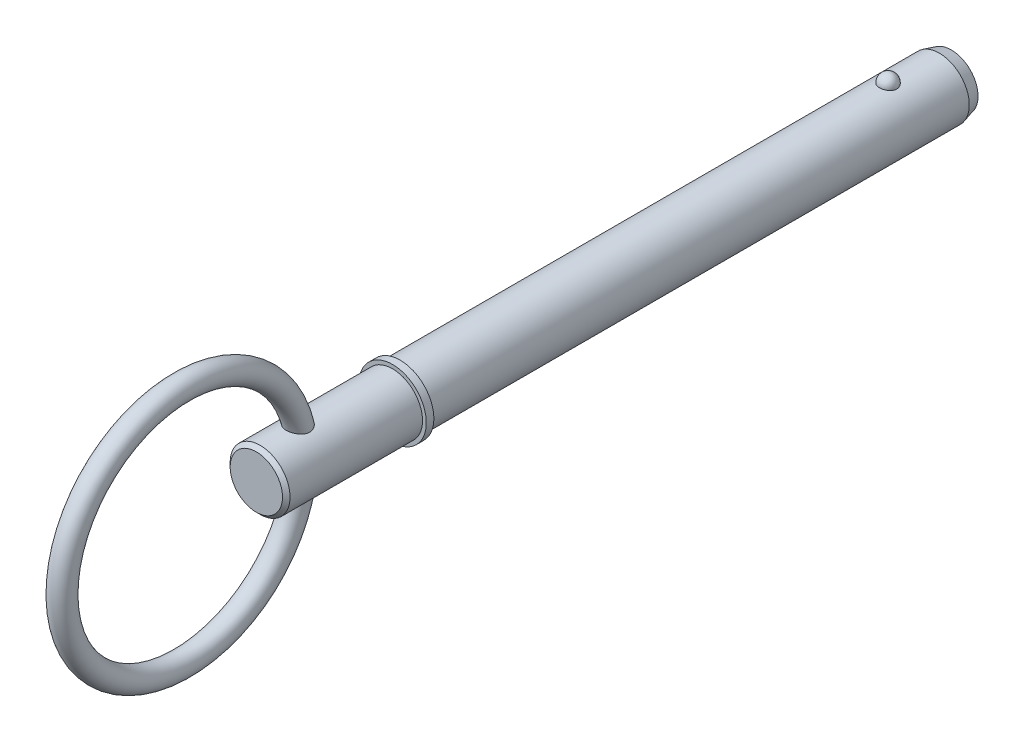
ISO-10303-21;
HEADER;
FILE_DESCRIPTION(('STEP AP214'),'2;1');
FILE_NAME('part.step','',(''),(''),'','','');
FILE_SCHEMA(('AUTOMOTIVE_DESIGN { 1 0 10303 214 1 1 1 1 }'));
ENDSEC;
DATA;
#1=APPLICATION_CONTEXT('core data for automotive mechanical design processes');
#2=APPLICATION_PROTOCOL_DEFINITION('international standard','automotive_design',2000,#1);
#3=PRODUCT_CONTEXT('',#1,'mechanical');
#4=PRODUCT('Part','Part','',(#3));
#5=PRODUCT_RELATED_PRODUCT_CATEGORY('part','',(#4));
#6=PRODUCT_DEFINITION_FORMATION('','',#4);
#7=PRODUCT_DEFINITION_CONTEXT('part definition',#1,'design');
#8=PRODUCT_DEFINITION('design','',#6,#7);
#9=PRODUCT_DEFINITION_SHAPE('','',#8);
#10=(LENGTH_UNIT() NAMED_UNIT(*) SI_UNIT(.MILLI.,.METRE.));
#11=(NAMED_UNIT(*) PLANE_ANGLE_UNIT() SI_UNIT($,.RADIAN.));
#12=(NAMED_UNIT(*) SI_UNIT($,.STERADIAN.) SOLID_ANGLE_UNIT());
#13=UNCERTAINTY_MEASURE_WITH_UNIT(LENGTH_MEASURE(1.E-05),#10,'distance_accuracy_value','');
#14=(GEOMETRIC_REPRESENTATION_CONTEXT(3) GLOBAL_UNCERTAINTY_ASSIGNED_CONTEXT((#13)) GLOBAL_UNIT_ASSIGNED_CONTEXT((#10,
#11,#12)) REPRESENTATION_CONTEXT('',''));
#15=CARTESIAN_POINT('',(0.,0.,0.));
#16=DIRECTION('',(0.,0.,1.));
#17=DIRECTION('',(1.,0.,0.));
#18=AXIS2_PLACEMENT_3D('',#15,#16,#17);
#19=CARTESIAN_POINT('',(0.,0.,63.5));
#20=DIRECTION('',(0.,0.,-1.));
#21=DIRECTION('',(-1.,0.,0.));
#22=AXIS2_PLACEMENT_3D('',#19,#20,#21);
#23=CYLINDRICAL_SURFACE('',#22,3.97);
#24=CARTESIAN_POINT('',(1.13787398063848,3.80343828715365,-1.15));
#25=CARTESIAN_POINT('',(1.13787307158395,3.80343910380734,-1.0857397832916));
#26=CARTESIAN_POINT('',(1.13264657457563,3.80501406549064,-1.02146820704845));
#27=CARTESIAN_POINT('',(1.11186534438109,3.81113760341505,-0.894749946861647));
#28=CARTESIAN_POINT('',(1.09630734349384,3.81568712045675,-0.832303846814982));
#29=CARTESIAN_POINT('',(1.05525533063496,3.82724281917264,-0.711040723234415));
#30=CARTESIAN_POINT('',(1.02976565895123,3.83424792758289,-0.652222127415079));
#31=CARTESIAN_POINT('',(0.969477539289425,3.84993235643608,-0.53981446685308));
#32=CARTESIAN_POINT('',(0.934679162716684,3.85861166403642,-0.486225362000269));
#33=CARTESIAN_POINT('',(0.856427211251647,3.87673176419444,-0.385470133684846));
#34=CARTESIAN_POINT('',(0.812928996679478,3.88617632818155,-0.338339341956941));
#35=CARTESIAN_POINT('',(0.718506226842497,3.90473543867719,-0.252134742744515));
#36=CARTESIAN_POINT('',(0.667581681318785,3.91384998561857,-0.213060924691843));
#37=CARTESIAN_POINT('',(0.559829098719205,3.93070626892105,-0.144169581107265));
#38=CARTESIAN_POINT('',(0.503019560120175,3.93845211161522,-0.114324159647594));
#39=CARTESIAN_POINT('',(0.384957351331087,3.95173781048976,-0.0645874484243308));
#40=CARTESIAN_POINT('',(0.323705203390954,3.95727792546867,-0.0446949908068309));
#41=CARTESIAN_POINT('',(0.1997490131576,3.96544869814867,-0.0157294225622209));
#42=CARTESIAN_POINT('',(0.137095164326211,3.96813298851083,-0.00645660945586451));
#43=CARTESIAN_POINT('',(0.0110617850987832,3.97048461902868,0.00167939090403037));
#44=CARTESIAN_POINT('',(-0.0523176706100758,3.97015226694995,0.000543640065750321));
#45=CARTESIAN_POINT('',(-0.176983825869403,3.96653606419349,-0.0120046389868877));
#46=CARTESIAN_POINT('',(-0.238287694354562,3.96329719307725,-0.0232605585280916));
#47=CARTESIAN_POINT('',(-0.358077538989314,3.95427494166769,-0.0555133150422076));
#48=CARTESIAN_POINT('',(-0.41656346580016,3.94849151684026,-0.0765103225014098));
#49=CARTESIAN_POINT('',(-0.529474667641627,3.9349475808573,-0.127824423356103));
#50=CARTESIAN_POINT('',(-0.583873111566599,3.92717527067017,-0.158197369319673));
#51=CARTESIAN_POINT('',(-0.686796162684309,3.9104901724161,-0.227402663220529));
#52=CARTESIAN_POINT('',(-0.735320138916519,3.90157726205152,-0.266235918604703));
#53=CARTESIAN_POINT('',(-0.826197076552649,3.88336108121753,-0.352210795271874));
#54=CARTESIAN_POINT('',(-0.868404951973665,3.87405356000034,-0.399504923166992));
#55=CARTESIAN_POINT('',(-0.944393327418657,3.85623507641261,-0.500572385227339));
#56=CARTESIAN_POINT('',(-0.978173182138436,3.84772417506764,-0.554346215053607));
#57=CARTESIAN_POINT('',(-1.036841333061,3.83233550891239,-0.667624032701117));
#58=CARTESIAN_POINT('',(-1.06161430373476,3.82547928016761,-0.727190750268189));
#59=CARTESIAN_POINT('',(-1.1010562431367,3.81431496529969,-0.849806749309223));
#60=CARTESIAN_POINT('',(-1.11572551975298,3.81000680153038,-0.912855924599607));
#61=CARTESIAN_POINT('',(-1.13455293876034,3.80444307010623,-1.04035299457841));
#62=CARTESIAN_POINT('',(-1.13875701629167,3.80317416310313,-1.10479351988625));
#63=CARTESIAN_POINT('',(-1.13668244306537,3.80379469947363,-1.23348881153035));
#64=CARTESIAN_POINT('',(-1.13040410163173,3.80568404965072,-1.29774358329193));
#65=CARTESIAN_POINT('',(-1.10758455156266,3.81238701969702,-1.42388263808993));
#66=CARTESIAN_POINT('',(-1.09109911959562,3.81718474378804,-1.48577787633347));
#67=CARTESIAN_POINT('',(-1.04831897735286,3.82915360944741,-1.6058363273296));
#68=CARTESIAN_POINT('',(-1.02202385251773,3.83632485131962,-1.66399938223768));
#69=CARTESIAN_POINT('',(-0.960087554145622,3.85229234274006,-1.77531672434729));
#70=CARTESIAN_POINT('',(-0.924393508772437,3.86109769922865,-1.82844028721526));
#71=CARTESIAN_POINT('',(-0.844617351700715,3.87932868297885,-1.92784641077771));
#72=CARTESIAN_POINT('',(-0.800534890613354,3.88875433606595,-1.97412868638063));
#73=CARTESIAN_POINT('',(-0.704909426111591,3.90722138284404,-2.05875748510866));
#74=CARTESIAN_POINT('',(-0.653336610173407,3.91626104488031,-2.09707073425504));
#75=CARTESIAN_POINT('',(-0.544251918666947,3.93290335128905,-2.16444159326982));
#76=CARTESIAN_POINT('',(-0.486740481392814,3.94050610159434,-2.19349988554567));
#77=CARTESIAN_POINT('',(-0.368186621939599,3.95333328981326,-2.24120607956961));
#78=CARTESIAN_POINT('',(-0.307200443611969,3.9585876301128,-2.25998559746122));
#79=CARTESIAN_POINT('',(-0.182787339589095,3.96627905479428,-2.28716436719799));
#80=CARTESIAN_POINT('',(-0.119360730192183,3.96871650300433,-2.29556495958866));
#81=CARTESIAN_POINT('',(0.00676344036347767,3.97048518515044,-2.30167748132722));
#82=CARTESIAN_POINT('',(0.0694499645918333,3.96987797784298,-2.299601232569));
#83=CARTESIAN_POINT('',(0.193555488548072,3.96576491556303,-2.28530777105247));
#84=CARTESIAN_POINT('',(0.254974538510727,3.96225917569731,-2.27309096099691));
#85=CARTESIAN_POINT('',(0.374550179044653,3.95274547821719,-2.2389384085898));
#86=CARTESIAN_POINT('',(0.432719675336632,3.94674835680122,-2.2170447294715));
#87=CARTESIAN_POINT('',(0.544514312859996,3.93288448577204,-2.16414952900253));
#88=CARTESIAN_POINT('',(0.598139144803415,3.92501760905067,-2.13314738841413));
#89=CARTESIAN_POINT('',(0.700284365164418,3.90809781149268,-2.06228741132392));
#90=CARTESIAN_POINT('',(0.748708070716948,3.89902775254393,-2.02229434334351));
#91=CARTESIAN_POINT('',(0.838215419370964,3.88077133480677,-1.93481443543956));
#92=CARTESIAN_POINT('',(0.879297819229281,3.87158495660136,-1.88732632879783));
#93=CARTESIAN_POINT('',(0.953804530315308,3.85391414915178,-1.78516284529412));
#94=CARTESIAN_POINT('',(0.987071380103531,3.8454460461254,-1.73036973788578));
#95=CARTESIAN_POINT('',(1.04410491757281,3.83035507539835,-1.61582422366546));
#96=CARTESIAN_POINT('',(1.06787445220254,3.82373165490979,-1.5560733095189));
#97=CARTESIAN_POINT('',(1.10358064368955,3.813570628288,-1.43904746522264));
#98=CARTESIAN_POINT('',(1.11641754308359,3.80980198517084,-1.38206535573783));
#99=CARTESIAN_POINT('',(1.13356451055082,3.80473547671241,-1.26672526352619));
#100=CARTESIAN_POINT('',(1.13787480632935,3.80343754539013,-1.20836731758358));
#101=CARTESIAN_POINT('',(1.13787398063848,3.80343828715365,-1.15));
#102=B_SPLINE_CURVE_WITH_KNOTS('',3,(#24,#25,#26,#27,#28,#29,#30,#31,#32,#33,#34,#35,#36,#37,
#38,#39,#40,#41,#42,#43,#44,#45,#46,#47,#48,#49,#50,#51,#52,#53,#54,#55,#56,#57,#58,#59,#60,#61,
#62,#63,#64,#65,#66,#67,#68,#69,#70,#71,#72,#73,#74,#75,#76,#77,#78,#79,#80,#81,#82,#83,#84,#85,
#86,#87,#88,#89,#90,#91,#92,#93,#94,#95,#96,#97,#98,#99,#100,#101),.UNSPECIFIED.,.T.,.F.,(4,2,2,
2,2,2,2,2,2,2,2,2,2,2,2,2,2,2,2,2,2,2,2,2,2,2,2,2,2,2,2,2,2,2,2,2,2,2,4),(0.,0.192571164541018,
0.385203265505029,0.577751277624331,0.770297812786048,0.963858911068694,1.15741975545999,
1.35038964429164,1.54333688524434,1.73259288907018,1.92182958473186,2.10818732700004,
2.2945483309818,2.48204164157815,2.66955507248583,2.86087083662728,3.05220124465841,
3.24590171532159,3.43959628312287,3.63243915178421,3.82527632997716,4.01706893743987,
4.20886965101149,4.40177324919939,4.59468488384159,4.78838651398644,4.9820738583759,
5.17321934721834,5.36434014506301,5.55161251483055,5.7388774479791,5.92533626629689,
6.11180776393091,6.30129785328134,6.49082000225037,6.68388392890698,6.87688993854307,
7.05180628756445,7.22671796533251),.UNSPECIFIED.);
#103=CARTESIAN_POINT('',(1.13787398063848,3.80343828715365,-1.15));
#104=VERTEX_POINT('',#103);
#105=EDGE_CURVE('E102',#104,#104,#102,.T.);
#106=ORIENTED_EDGE('',*,*,#105,.T.);
#107=EDGE_LOOP('',(#106));
#108=FACE_BOUND('',#107,.T.);
#109=CARTESIAN_POINT('',(0.,0.,-7.94399999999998));
#110=DIRECTION('',(0.,0.,-1.));
#111=DIRECTION('',(-1.,0.,0.));
#112=AXIS2_PLACEMENT_3D('',#109,#110,#111);
#113=CIRCLE('',#112,3.97);
#114=CARTESIAN_POINT('',(-3.97,0.,-7.94399999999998));
#115=VERTEX_POINT('',#114);
#116=EDGE_CURVE('E110',#115,#115,#113,.F.);
#117=ORIENTED_EDGE('',*,*,#116,.T.);
#118=EDGE_LOOP('',(#117));
#119=FACE_BOUND('',#118,.T.);
#120=CARTESIAN_POINT('',(0.,0.,63.5));
#121=DIRECTION('',(0.,0.,1.));
#122=DIRECTION('',(1.,0.,0.));
#123=AXIS2_PLACEMENT_3D('',#120,#121,#122);
#124=CIRCLE('',#123,3.97);
#125=CARTESIAN_POINT('',(3.97,0.,63.5));
#126=VERTEX_POINT('',#125);
#127=EDGE_CURVE('E108',#126,#126,#124,.T.);
#128=ORIENTED_EDGE('',*,*,#127,.F.);
#129=EDGE_LOOP('',(#128));
#130=FACE_BOUND('',#129,.T.);
#131=ADVANCED_FACE('F39',(#108,#119,#130),#23,.T.);
#132=CARTESIAN_POINT('',(0.,0.,-9.53));
#133=DIRECTION('',(0.,0.,-1.));
#134=DIRECTION('',(-1.,0.,0.));
#135=AXIS2_PLACEMENT_3D('',#132,#133,#134);
#136=PLANE('',#135);
#137=CARTESIAN_POINT('',(0.,0.,-9.53));
#138=DIRECTION('',(0.,0.,-1.));
#139=DIRECTION('',(-1.,0.,0.));
#140=AXIS2_PLACEMENT_3D('',#137,#138,#139);
#141=CIRCLE('',#140,3.54503258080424);
#142=CARTESIAN_POINT('',(-3.54503258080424,0.,-9.53));
#143=VERTEX_POINT('',#142);
#144=EDGE_CURVE('E142',#143,#143,#141,.T.);
#145=ORIENTED_EDGE('',*,*,#144,.T.);
#146=EDGE_LOOP('',(#145));
#147=FACE_BOUND('',#146,.T.);
#148=ADVANCED_FACE('F88',(#147),#136,.T.);
#149=CARTESIAN_POINT('',(0.,0.,-9.53));
#150=DIRECTION('',(0.,0.,1.));
#151=DIRECTION('',(1.,0.,0.));
#152=AXIS2_PLACEMENT_3D('',#149,#150,#151);
#153=CONICAL_SURFACE('',#152,3.54503258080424,0.261799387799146);
#154=ORIENTED_EDGE('',*,*,#116,.F.);
#155=EDGE_LOOP('',(#154));
#156=FACE_BOUND('',#155,.T.);
#157=ORIENTED_EDGE('',*,*,#144,.F.);
#158=EDGE_LOOP('',(#157));
#159=FACE_BOUND('',#158,.T.);
#160=ADVANCED_FACE('F94',(#156,#159),#153,.T.);
#161=CARTESIAN_POINT('',(0.,3.97,-1.15));
#162=DIRECTION('',(0.,1.,0.));
#163=DIRECTION('',(0.,0.,-1.));
#164=AXIS2_PLACEMENT_3D('',#161,#162,#163);
#165=SPHERICAL_SURFACE('',#164,1.15);
#166=ORIENTED_EDGE('',*,*,#105,.F.);
#167=EDGE_LOOP('',(#166));
#168=FACE_BOUND('',#167,.T.);
#169=ADVANCED_FACE('F113',(#168),#165,.T.);
#170=CARTESIAN_POINT('',(0.,0.,63.5));
#171=DIRECTION('',(0.,0.,-1.));
#172=DIRECTION('',(-1.,0.,0.));
#173=AXIS2_PLACEMENT_3D('',#170,#171,#172);
#174=PLANE('',#173);
#175=ORIENTED_EDGE('',*,*,#127,.T.);
#176=EDGE_LOOP('',(#175));
#177=FACE_BOUND('',#176,.T.);
#178=CARTESIAN_POINT('',(0.,0.,63.5));
#179=DIRECTION('',(0.,0.,-1.));
#180=DIRECTION('',(-1.,0.,0.));
#181=AXIS2_PLACEMENT_3D('',#178,#179,#180);
#182=CIRCLE('',#181,4.47);
#183=CARTESIAN_POINT('',(-4.47,0.,63.5));
#184=VERTEX_POINT('',#183);
#185=EDGE_CURVE('E109',#184,#184,#182,.T.);
#186=ORIENTED_EDGE('',*,*,#185,.T.);
#187=EDGE_LOOP('',(#186));
#188=FACE_BOUND('',#187,.T.);
#189=ADVANCED_FACE('F117',(#177,#188),#174,.T.);
#190=CARTESIAN_POINT('',(0.,0.,33.7287874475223));
#191=DIRECTION('',(0.,0.,-1.));
#192=DIRECTION('',(-1.,0.,0.));
#193=AXIS2_PLACEMENT_3D('',#190,#191,#192);
#194=CYLINDRICAL_SURFACE('',#193,4.47);
#195=CARTESIAN_POINT('',(0.,0.,64.5));
#196=DIRECTION('',(0.,0.,-1.));
#197=DIRECTION('',(-1.,0.,0.));
#198=AXIS2_PLACEMENT_3D('',#195,#196,#197);
#199=CIRCLE('',#198,4.47);
#200=CARTESIAN_POINT('',(-4.47,0.,64.5));
#201=VERTEX_POINT('',#200);
#202=EDGE_CURVE('E134',#201,#201,#199,.T.);
#203=ORIENTED_EDGE('',*,*,#202,.T.);
#204=EDGE_LOOP('',(#203));
#205=FACE_BOUND('',#204,.T.);
#206=ORIENTED_EDGE('',*,*,#185,.F.);
#207=EDGE_LOOP('',(#206));
#208=FACE_BOUND('',#207,.T.);
#209=ADVANCED_FACE('F121',(#205,#208),#194,.T.);
#210=CARTESIAN_POINT('',(0.,4.47,64.5));
#211=DIRECTION('',(0.,0.,1.));
#212=DIRECTION('',(1.,0.,0.));
#213=AXIS2_PLACEMENT_3D('',#210,#211,#212);
#214=PLANE('',#213);
#215=CARTESIAN_POINT('',(0.,0.,64.5));
#216=DIRECTION('',(0.,0.,1.));
#217=DIRECTION('',(1.,0.,0.));
#218=AXIS2_PLACEMENT_3D('',#215,#216,#217);
#219=CIRCLE('',#218,3.97);
#220=CARTESIAN_POINT('',(3.97,0.,64.5));
#221=VERTEX_POINT('',#220);
#222=EDGE_CURVE('E112',#221,#221,#219,.T.);
#223=ORIENTED_EDGE('',*,*,#222,.F.);
#224=EDGE_LOOP('',(#223));
#225=FACE_BOUND('',#224,.T.);
#226=ORIENTED_EDGE('',*,*,#202,.F.);
#227=EDGE_LOOP('',(#226));
#228=FACE_BOUND('',#227,.T.);
#229=ADVANCED_FACE('F85',(#225,#228),#214,.T.);
#230=CARTESIAN_POINT('',(0.,0.,82.55));
#231=DIRECTION('',(0.,0.,-1.));
#232=DIRECTION('',(-1.,0.,0.));
#233=AXIS2_PLACEMENT_3D('',#230,#231,#232);
#234=CYLINDRICAL_SURFACE('',#233,3.97);
#235=CARTESIAN_POINT('',(-0.740636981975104,-3.90030215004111,75.6942081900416));
#236=CARTESIAN_POINT('',(-0.667733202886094,-3.91414543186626,75.654930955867));
#237=CARTESIAN_POINT('',(-0.591347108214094,-3.92651643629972,75.6215983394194));
#238=CARTESIAN_POINT('',(-0.433709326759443,-3.94703799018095,75.5675410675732));
#239=CARTESIAN_POINT('',(-0.352458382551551,-3.95518918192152,75.5468144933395));
#240=CARTESIAN_POINT('',(-0.187320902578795,-3.96644185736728,75.5184263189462));
#241=CARTESIAN_POINT('',(-0.103433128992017,-3.9695409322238,75.5107709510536));
#242=CARTESIAN_POINT('',(0.0645297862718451,-3.97036376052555,75.5087268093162));
#243=CARTESIAN_POINT('',(0.148604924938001,-3.96808759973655,75.5143378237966));
#244=CARTESIAN_POINT('',(0.313967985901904,-3.95842655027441,75.5386101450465));
#245=CARTESIAN_POINT('',(0.395270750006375,-3.95107581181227,75.5571842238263));
#246=CARTESIAN_POINT('',(0.553418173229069,-3.93204472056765,75.6068699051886));
#247=CARTESIAN_POINT('',(0.63026242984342,-3.92036397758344,75.6379826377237));
#248=CARTESIAN_POINT('',(0.777983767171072,-3.89375421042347,75.7123739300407));
#249=CARTESIAN_POINT('',(0.848809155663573,-3.8788003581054,75.7557462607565));
#250=CARTESIAN_POINT('',(0.981880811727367,-3.84727071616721,75.8536515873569));
#251=CARTESIAN_POINT('',(1.04412630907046,-3.83069478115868,75.9081855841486));
#252=CARTESIAN_POINT('',(1.15846819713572,-3.79768496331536,76.0274397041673));
#253=CARTESIAN_POINT('',(1.21053047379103,-3.78125172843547,76.0921927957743));
#254=CARTESIAN_POINT('',(1.30266807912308,-3.75050988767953,76.2301698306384));
#255=CARTESIAN_POINT('',(1.34274789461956,-3.73620048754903,76.3033905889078));
#256=CARTESIAN_POINT('',(1.40857853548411,-3.71187334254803,76.4536278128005));
#257=CARTESIAN_POINT('',(1.43477198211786,-3.70172571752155,76.5304292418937));
#258=CARTESIAN_POINT('',(1.47426417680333,-3.68617713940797,76.6877211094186));
#259=CARTESIAN_POINT('',(1.48756557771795,-3.68077520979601,76.768210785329));
#260=CARTESIAN_POINT('',(1.5011302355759,-3.67526295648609,76.9282774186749));
#261=CARTESIAN_POINT('',(1.50172918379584,-3.67501639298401,77.0078221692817));
#262=CARTESIAN_POINT('',(1.4912869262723,-3.67926498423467,77.1660010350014));
#263=CARTESIAN_POINT('',(1.48024221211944,-3.68376156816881,77.2446348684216));
#264=CARTESIAN_POINT('',(1.44631002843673,-3.69722026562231,77.4039961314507));
#265=CARTESIAN_POINT('',(1.42273446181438,-3.7064405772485,77.4845537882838));
#266=CARTESIAN_POINT('',(1.36440745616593,-3.7283048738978,77.6410229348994));
#267=CARTESIAN_POINT('',(1.32965006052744,-3.74095068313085,77.7169319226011));
#268=CARTESIAN_POINT('',(1.24498396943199,-3.77003365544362,77.8715893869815));
#269=CARTESIAN_POINT('',(1.19374759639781,-3.78674477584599,77.9495625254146));
#270=CARTESIAN_POINT('',(1.07927226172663,-3.82094743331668,78.096060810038));
#271=CARTESIAN_POINT('',(1.0160234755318,-3.83843960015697,78.1645781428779));
#272=CARTESIAN_POINT('',(0.875824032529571,-3.87288453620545,78.2922425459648));
#273=CARTESIAN_POINT('',(0.798445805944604,-3.88979192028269,78.3509375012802));
#274=CARTESIAN_POINT('',(0.633271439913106,-3.92005992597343,78.4524486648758));
#275=CARTESIAN_POINT('',(0.545492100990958,-3.9334261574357,78.4952900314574));
#276=CARTESIAN_POINT('',(0.374503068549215,-3.9531041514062,78.5573026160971));
#277=CARTESIAN_POINT('',(0.292250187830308,-3.96011991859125,78.5788718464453));
#278=CARTESIAN_POINT('',(0.124887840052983,-3.96891507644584,78.6058171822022));
#279=CARTESIAN_POINT('',(0.0397822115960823,-3.97070123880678,78.611214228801));
#280=CARTESIAN_POINT('',(-0.116598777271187,-3.96893737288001,78.6058414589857));
#281=CARTESIAN_POINT('',(-0.187977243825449,-3.96616998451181,78.5974431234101));
#282=CARTESIAN_POINT('',(-0.32822445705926,-3.95703238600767,78.5693459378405));
#283=CARTESIAN_POINT('',(-0.397092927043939,-3.95066177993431,78.5496458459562));
#284=CARTESIAN_POINT('',(-0.530777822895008,-3.93493622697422,78.5000024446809));
#285=CARTESIAN_POINT('',(-0.59558598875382,-3.92557541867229,78.4700390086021));
#286=CARTESIAN_POINT('',(-0.719890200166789,-3.904694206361,78.4012213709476));
#287=CARTESIAN_POINT('',(-0.779384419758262,-3.89317306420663,78.3623641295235));
#288=CARTESIAN_POINT('',(-0.900171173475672,-3.86715924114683,78.2711356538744));
#289=CARTESIAN_POINT('',(-0.960570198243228,-3.85247602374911,78.2176378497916));
#290=CARTESIAN_POINT('',(-1.07286582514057,-3.82272677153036,78.1024377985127));
#291=CARTESIAN_POINT('',(-1.12475588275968,-3.8076604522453,78.0407293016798));
#292=CARTESIAN_POINT('',(-1.22682603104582,-3.7761197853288,77.9003072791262));
#293=CARTESIAN_POINT('',(-1.27547686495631,-3.75979238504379,77.8204426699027));
#294=CARTESIAN_POINT('',(-1.35956460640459,-3.73021138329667,77.6534537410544));
#295=CARTESIAN_POINT('',(-1.39499536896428,-3.71695921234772,77.5663260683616));
#296=CARTESIAN_POINT('',(-1.45224550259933,-3.6949785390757,77.3837644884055));
#297=CARTESIAN_POINT('',(-1.47355906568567,-3.68641985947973,77.2881485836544));
#298=CARTESIAN_POINT('',(-1.49891316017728,-3.67618897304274,77.0943060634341));
#299=CARTESIAN_POINT('',(-1.50297414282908,-3.67450861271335,76.9960826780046));
#300=CARTESIAN_POINT('',(-1.49322338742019,-3.67847743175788,76.8115204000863));
#301=CARTESIAN_POINT('',(-1.48132891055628,-3.68334053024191,76.725062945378));
#302=CARTESIAN_POINT('',(-1.44277978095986,-3.69860964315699,76.5560202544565));
#303=CARTESIAN_POINT('',(-1.4161310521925,-3.70901343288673,76.4734334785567));
#304=CARTESIAN_POINT('',(-1.35164005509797,-3.73296583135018,76.3217432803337));
#305=CARTESIAN_POINT('',(-1.31494998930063,-3.7461693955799,76.2520907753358));
#306=CARTESIAN_POINT('',(-1.23078033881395,-3.77465882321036,76.1201142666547));
#307=CARTESIAN_POINT('',(-1.18329862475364,-3.7899450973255,76.0577917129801));
#308=CARTESIAN_POINT('',(-1.07555346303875,-3.82196646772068,75.938244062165));
#309=CARTESIAN_POINT('',(-1.01467770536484,-3.83873247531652,75.8815789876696));
#310=CARTESIAN_POINT('',(-0.883925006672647,-3.87093079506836,75.779334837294));
#311=CARTESIAN_POINT('',(-0.81404638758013,-3.88636285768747,75.7337578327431));
#312=CARTESIAN_POINT('',(-0.740636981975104,-3.90030215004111,75.6942081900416));
#313=B_SPLINE_CURVE_WITH_KNOTS('',3,(#235,#236,#237,#238,#239,#240,#241,#242,#243,#244,#245,
#246,#247,#248,#249,#250,#251,#252,#253,#254,#255,#256,#257,#258,#259,#260,#261,#262,#263,#264,
#265,#266,#267,#268,#269,#270,#271,#272,#273,#274,#275,#276,#277,#278,#279,#280,#281,#282,#283,
#284,#285,#286,#287,#288,#289,#290,#291,#292,#293,#294,#295,#296,#297,#298,#299,#300,#301,#302,
#303,#304,#305,#306,#307,#308,#309,#310,#311,#312),.UNSPECIFIED.,.T.,.F.,(4,2,2,2,2,2,2,2,2,2,2,
2,2,2,2,2,2,2,2,2,2,2,2,2,2,2,2,2,2,2,2,2,2,2,2,2,2,2,4),(0.,0.251585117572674,
0.503131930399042,0.75479864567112,1.00646134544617,1.25644674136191,1.50645467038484,
1.75842915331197,2.01042624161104,2.26325358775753,2.51598614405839,2.76008726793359,
3.00413815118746,3.24173115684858,3.47939577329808,3.73171171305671,3.9841622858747,
4.26728153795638,4.55063334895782,4.8446962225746,5.13829042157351,5.39265192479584,
5.64668391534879,5.86142364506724,6.07618697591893,6.29137389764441,6.50663447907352,
6.75172833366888,6.99700982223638,7.28055118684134,7.56422418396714,7.85757857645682,
8.15058512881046,8.41135406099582,8.67201836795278,8.9103901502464,9.14880900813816,
9.40209172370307,9.65542171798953),.UNSPECIFIED.);
#314=CARTESIAN_POINT('',(-0.740636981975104,-3.90030215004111,75.6942081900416));
#315=VERTEX_POINT('',#314);
#316=EDGE_CURVE('E10',#315,#315,#313,.T.);
#317=ORIENTED_EDGE('',*,*,#316,.F.);
#318=EDGE_LOOP('',(#317));
#319=FACE_BOUND('',#318,.T.);
#320=CARTESIAN_POINT('',(-0.740636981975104,3.90030215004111,75.6942081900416));
#321=CARTESIAN_POINT('',(-0.813118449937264,3.88653971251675,75.7332571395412));
#322=CARTESIAN_POINT('',(-0.8821496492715,3.8713229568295,75.7781781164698));
#323=CARTESIAN_POINT('',(-1.01146335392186,3.83956738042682,75.8788428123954));
#324=CARTESIAN_POINT('',(-1.07174704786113,3.82302873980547,75.9345850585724));
#325=CARTESIAN_POINT('',(-1.18196955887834,3.79040422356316,76.0557938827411));
#326=CARTESIAN_POINT('',(-1.23189269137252,3.77431906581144,76.121274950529));
#327=CARTESIAN_POINT('',(-1.31978443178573,3.74449359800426,76.2602948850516));
#328=CARTESIAN_POINT('',(-1.35775694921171,3.73075252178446,76.3338311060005));
#329=CARTESIAN_POINT('',(-1.41974909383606,3.7075981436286,76.4847128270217));
#330=CARTESIAN_POINT('',(-1.44413408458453,3.69807309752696,76.5618910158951));
#331=CARTESIAN_POINT('',(-1.4800654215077,3.6838411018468,76.719590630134));
#332=CARTESIAN_POINT('',(-1.49161368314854,3.67913343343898,76.8001115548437));
#333=CARTESIAN_POINT('',(-1.50187378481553,3.67495610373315,76.9602618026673));
#334=CARTESIAN_POINT('',(-1.50086613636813,3.67537197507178,77.0398709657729));
#335=CARTESIAN_POINT('',(-1.48728932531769,3.68088569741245,77.1979172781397));
#336=CARTESIAN_POINT('',(-1.47471654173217,3.68598501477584,77.2763540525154));
#337=CARTESIAN_POINT('',(-1.43761932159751,3.70061780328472,77.4355940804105));
#338=CARTESIAN_POINT('',(-1.41233843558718,3.71042990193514,77.5161940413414));
#339=CARTESIAN_POINT('',(-1.3505731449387,3.73335405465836,77.6724850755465));
#340=CARTESIAN_POINT('',(-1.31408239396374,3.74646797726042,77.7481733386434));
#341=CARTESIAN_POINT('',(-1.2257172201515,3.77636700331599,77.9020428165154));
#342=CARTESIAN_POINT('',(-1.17251505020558,3.79340436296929,77.9794161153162));
#343=CARTESIAN_POINT('',(-1.05406412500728,3.82800923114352,78.1243069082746));
#344=CARTESIAN_POINT('',(-0.988806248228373,3.84557713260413,78.1918168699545));
#345=CARTESIAN_POINT('',(-0.845287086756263,3.87968695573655,78.3162211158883));
#346=CARTESIAN_POINT('',(-0.766724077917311,3.89618874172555,78.3727822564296));
#347=CARTESIAN_POINT('',(-0.5995381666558,3.92537936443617,78.4696962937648));
#348=CARTESIAN_POINT('',(-0.510933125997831,3.93807482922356,78.5100774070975));
#349=CARTESIAN_POINT('',(-0.339677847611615,3.95624165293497,78.5670085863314));
#350=CARTESIAN_POINT('',(-0.257968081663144,3.96248273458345,78.5861280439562));
#351=CARTESIAN_POINT('',(-0.0922002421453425,3.96979198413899,78.6084736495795));
#352=CARTESIAN_POINT('',(-0.00814495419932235,3.97086604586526,78.6117179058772));
#353=CARTESIAN_POINT('',(0.146484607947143,3.96793776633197,78.6027977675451));
#354=CARTESIAN_POINT('',(0.217212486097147,3.96466338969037,78.5928433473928));
#355=CARTESIAN_POINT('',(0.355938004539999,3.95462310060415,78.5618888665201));
#356=CARTESIAN_POINT('',(0.423935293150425,3.94785673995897,78.540887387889));
#357=CARTESIAN_POINT('',(0.556534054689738,3.93137424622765,78.4886148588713));
#358=CARTESIAN_POINT('',(0.621075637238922,3.92161865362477,78.4572059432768));
#359=CARTESIAN_POINT('',(0.744663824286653,3.90004074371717,78.3855756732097));
#360=CARTESIAN_POINT('',(0.803708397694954,3.88821766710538,78.3453510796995));
#361=CARTESIAN_POINT('',(0.923664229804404,3.86161149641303,78.2510569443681));
#362=CARTESIAN_POINT('',(0.983622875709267,3.84664723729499,78.1958282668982));
#363=CARTESIAN_POINT('',(1.09477654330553,3.816501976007,78.0771942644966));
#364=CARTESIAN_POINT('',(1.14596459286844,3.80132081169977,78.0137825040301));
#365=CARTESIAN_POINT('',(1.24603510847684,3.76980809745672,77.8699890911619));
#366=CARTESIAN_POINT('',(1.29338223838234,3.753652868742,77.7884933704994));
#367=CARTESIAN_POINT('',(1.37450267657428,3.72471527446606,77.6183960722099));
#368=CARTESIAN_POINT('',(1.40827109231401,3.71193412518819,77.5297919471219));
#369=CARTESIAN_POINT('',(1.46140533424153,3.6913461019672,77.3455436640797));
#370=CARTESIAN_POINT('',(1.48042991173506,3.6836576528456,77.2497859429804));
#371=CARTESIAN_POINT('',(1.50115029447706,3.67526750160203,77.0561286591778));
#372=CARTESIAN_POINT('',(1.50286713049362,3.67455732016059,76.9582318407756));
#373=CARTESIAN_POINT('',(1.48878143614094,3.68028077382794,76.7752085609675));
#374=CARTESIAN_POINT('',(1.47496153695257,3.68590609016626,76.6899028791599));
#375=CARTESIAN_POINT('',(1.43287242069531,3.70247002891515,76.5234763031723));
#376=CARTESIAN_POINT('',(1.40460762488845,3.7134070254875,76.4423541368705));
#377=CARTESIAN_POINT('',(1.33714680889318,3.7381964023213,76.2931046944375));
#378=CARTESIAN_POINT('',(1.29898330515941,3.7517524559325,76.2244572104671));
#379=CARTESIAN_POINT('',(1.21206000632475,3.78072797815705,76.0946829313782));
#380=CARTESIAN_POINT('',(1.16329942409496,3.79614758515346,76.0335566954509));
#381=CARTESIAN_POINT('',(1.05526740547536,3.82760231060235,75.9188656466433));
#382=CARTESIAN_POINT('',(0.995782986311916,3.84364346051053,75.8655033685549));
#383=CARTESIAN_POINT('',(0.868651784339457,3.87435388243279,75.7690998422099));
#384=CARTESIAN_POINT('',(0.801003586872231,3.88902291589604,75.7260603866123));
#385=CARTESIAN_POINT('',(0.656696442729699,3.91602140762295,75.6497891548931));
#386=CARTESIAN_POINT('',(0.579799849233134,3.92824686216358,75.6169691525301));
#387=CARTESIAN_POINT('',(0.421219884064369,3.94839960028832,75.5640374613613));
#388=CARTESIAN_POINT('',(0.339536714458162,3.95632706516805,75.5439252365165));
#389=CARTESIAN_POINT('',(0.173681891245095,3.96706909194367,75.5168661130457));
#390=CARTESIAN_POINT('',(0.0895101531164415,3.96988347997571,75.5099196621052));
#391=CARTESIAN_POINT('',(-0.0788915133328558,3.97010941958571,75.5093589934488));
#392=CARTESIAN_POINT('',(-0.163121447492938,3.96752031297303,75.5157463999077));
#393=CARTESIAN_POINT('',(-0.332911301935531,3.9569711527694,75.5422872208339));
#394=CARTESIAN_POINT('',(-0.41836320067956,3.9487768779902,75.5630414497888));
#395=CARTESIAN_POINT('',(-0.584033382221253,3.92769448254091,75.6184250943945));
#396=CARTESIAN_POINT('',(-0.664251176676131,3.91480592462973,75.6530558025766));
#397=CARTESIAN_POINT('',(-0.740636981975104,3.90030215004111,75.6942081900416));
#398=B_SPLINE_CURVE_WITH_KNOTS('',3,(#320,#321,#322,#323,#324,#325,#326,#327,#328,#329,#330,
#331,#332,#333,#334,#335,#336,#337,#338,#339,#340,#341,#342,#343,#344,#345,#346,#347,#348,#349,
#350,#351,#352,#353,#354,#355,#356,#357,#358,#359,#360,#361,#362,#363,#364,#365,#366,#367,#368,
#369,#370,#371,#372,#373,#374,#375,#376,#377,#378,#379,#380,#381,#382,#383,#384,#385,#386,#387,
#388,#389,#390,#391,#392,#393,#394,#395,#396,#397),.UNSPECIFIED.,.T.,.F.,(4,2,2,2,2,2,2,2,2,2,2,
2,2,2,2,2,2,2,2,2,2,2,2,2,2,2,2,2,2,2,2,2,2,2,2,2,2,2,4),(0.,0.250115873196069,
0.500197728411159,0.750655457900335,1.00103116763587,1.24430196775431,1.48753646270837,
1.72534678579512,1.96323159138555,2.21733609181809,2.47158471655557,2.75662009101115,
3.0418720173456,3.3347718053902,3.62715855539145,3.87803518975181,4.12862559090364,
4.34211896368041,4.55563974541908,4.77211030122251,4.98866052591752,5.23635199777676,
5.48423946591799,5.76983687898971,6.05553710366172,6.34766729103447,6.63944246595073,
6.89782349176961,7.15612548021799,7.3941467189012,7.63218564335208,7.87561406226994,
8.11908472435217,8.37137533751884,8.62365530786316,8.87594385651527,9.12826313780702,
9.39182737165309,9.65541616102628),.UNSPECIFIED.);
#399=CARTESIAN_POINT('',(-0.740636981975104,3.90030215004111,75.6942081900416));
#400=VERTEX_POINT('',#399);
#401=EDGE_CURVE('E51',#400,#400,#398,.T.);
#402=ORIENTED_EDGE('',*,*,#401,.F.);
#403=EDGE_LOOP('',(#402));
#404=FACE_BOUND('',#403,.T.);
#405=CARTESIAN_POINT('',(0.,0.,82.05));
#406=DIRECTION('',(0.,0.,-1.));
#407=DIRECTION('',(-1.,0.,0.));
#408=AXIS2_PLACEMENT_3D('',#405,#406,#407);
#409=CIRCLE('',#408,3.97);
#410=CARTESIAN_POINT('',(-3.97,0.,82.05));
#411=VERTEX_POINT('',#410);
#412=EDGE_CURVE('E64',#411,#411,#409,.T.);
#413=ORIENTED_EDGE('',*,*,#412,.T.);
#414=EDGE_LOOP('',(#413));
#415=FACE_BOUND('',#414,.T.);
#416=ORIENTED_EDGE('',*,*,#222,.T.);
#417=EDGE_LOOP('',(#416));
#418=FACE_BOUND('',#417,.T.);
#419=ADVANCED_FACE('F69',(#319,#404,#415,#418),#234,.T.);
#420=CARTESIAN_POINT('',(0.,0.,82.55));
#421=DIRECTION('',(0.,0.,-1.));
#422=DIRECTION('',(-1.,0.,0.));
#423=AXIS2_PLACEMENT_3D('',#420,#421,#422);
#424=PLANE('',#423);
#425=CARTESIAN_POINT('',(0.,0.,82.55));
#426=DIRECTION('',(0.,0.,-1.));
#427=DIRECTION('',(-1.,0.,0.));
#428=AXIS2_PLACEMENT_3D('',#425,#426,#427);
#429=CIRCLE('',#428,3.46999999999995);
#430=CARTESIAN_POINT('',(-3.46999999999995,0.,82.55));
#431=VERTEX_POINT('',#430);
#432=EDGE_CURVE('E58',#431,#431,#429,.F.);
#433=ORIENTED_EDGE('',*,*,#432,.T.);
#434=EDGE_LOOP('',(#433));
#435=FACE_BOUND('',#434,.T.);
#436=ADVANCED_FACE('F76',(#435),#424,.F.);
#437=CARTESIAN_POINT('',(0.,0.,82.05));
#438=DIRECTION('',(0.,0.,-1.));
#439=DIRECTION('',(-1.,0.,0.));
#440=AXIS2_PLACEMENT_3D('',#437,#438,#439);
#441=CONICAL_SURFACE('',#440,3.97,0.785398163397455);
#442=ORIENTED_EDGE('',*,*,#432,.F.);
#443=EDGE_LOOP('',(#442));
#444=FACE_BOUND('',#443,.T.);
#445=ORIENTED_EDGE('',*,*,#412,.F.);
#446=EDGE_LOOP('',(#445));
#447=FACE_BOUND('',#446,.T.);
#448=ADVANCED_FACE('F41',(#444,#447),#441,.T.);
#449=CARTESIAN_POINT('',(0.,0.,92.425));
#450=DIRECTION('',(1.,0.,0.));
#451=DIRECTION('',(0.,0.,-1.));
#452=AXIS2_PLACEMENT_3D('',#449,#450,#451);
#453=TOROIDAL_SURFACE('',#452,15.875,1.5);
#454=ORIENTED_EDGE('',*,*,#316,.T.);
#455=EDGE_LOOP('',(#454));
#456=FACE_BOUND('',#455,.T.);
#457=ORIENTED_EDGE('',*,*,#401,.T.);
#458=EDGE_LOOP('',(#457));
#459=FACE_BOUND('',#458,.T.);
#460=ADVANCED_FACE('F73',(#456,#459),#453,.T.);
#461=CLOSED_SHELL('',(#131,#148,#160,#169,#189,#209,#229,#419,#436,#448,#460));
#462=MANIFOLD_SOLID_BREP('B2',#461);
#463=ADVANCED_BREP_SHAPE_REPRESENTATION('',(#18,#462),#14);
#464=SHAPE_DEFINITION_REPRESENTATION(#9,#463);
ENDSEC;
END-ISO-10303-21;
